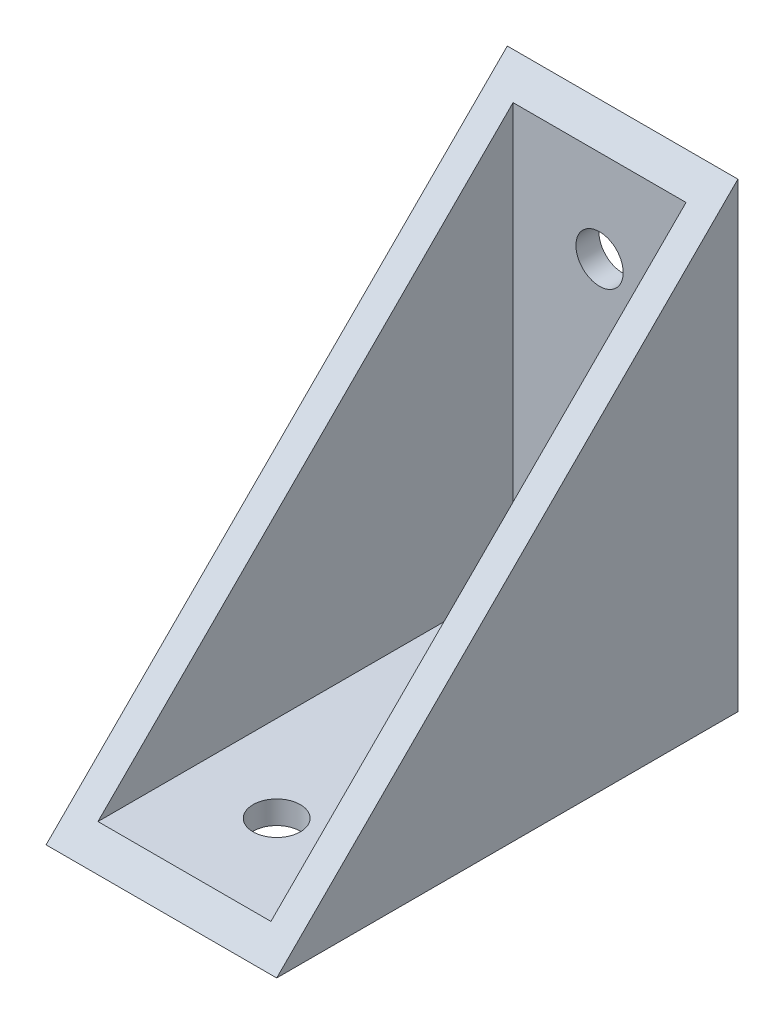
from build123d import *

# Parameters (mm, degrees)
AUFSATZ_LINEAR_AUSTRAGEN1_DEPTH = 20
SKIZZE2_W                       = 87.846758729
SKIZZE2_H                       = 80.957125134
SCHNITT_LINEAR_AUSTRAGEN1_DEPTH = 15
SKIZZE4_R                       = 4.1
SCHNITT_LINEAR_AUSTRAGEN2_DEPTH = 30
SKIZZE5_R                       = 4.1
SCHNITT_LINEAR_AUSTRAGEN3_DEPTH = 30


with BuildPart() as part:
    # Skizze1 → Aufsatz-Linear austragen1 (new, symmetric)
    with BuildSketch(Plane(origin=(0, 0, 0), x_dir=(0, 0, -1), z_dir=(1, 0, 0))):
        Polygon((-80, 0), (0, 80), (0, 0), align=None)
    extrude(amount=AUFSATZ_LINEAR_AUSTRAGEN1_DEPTH, both=True)

    # Skizze2 → Schnitt-Linear austragen1 (cut, symmetric)
    with BuildSketch(Plane(origin=(0, 0, 0), x_dir=(0, 0, -1), z_dir=(1, 0, 0))):
        with Locations((-47.923379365, 44.478562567)):
            Rectangle(SKIZZE2_W, SKIZZE2_H)
    extrude(amount=SCHNITT_LINEAR_AUSTRAGEN1_DEPTH, both=True, mode=Mode.SUBTRACT)

    # Skizze4 → Schnitt-Linear austragen2 (cut)
    with BuildSketch(Plane.XZ):
        with Locations(Location((0, 60, 0), (0, 0, 270))):
            Circle(SKIZZE4_R)
        with Locations(Location((0, 20, 0), (0, 0, 270))):
            Circle(SKIZZE4_R)
    extrude(amount=-SCHNITT_LINEAR_AUSTRAGEN2_DEPTH, mode=Mode.SUBTRACT)

    # Skizze5 → Schnitt-Linear austragen3 (cut)
    with BuildSketch(Plane(origin=(0, 0, 0), x_dir=(1, 0, 0), z_dir=(0, 0, -1))):
        with Locations(Location((0, -20, 0), (0, 0, 270))):
            Circle(SKIZZE5_R)
        with Locations(Location((0, -60, 0), (0, 0, 270))):
            Circle(SKIZZE5_R)
    extrude(amount=-SCHNITT_LINEAR_AUSTRAGEN3_DEPTH, mode=Mode.SUBTRACT)


solid = part.part
